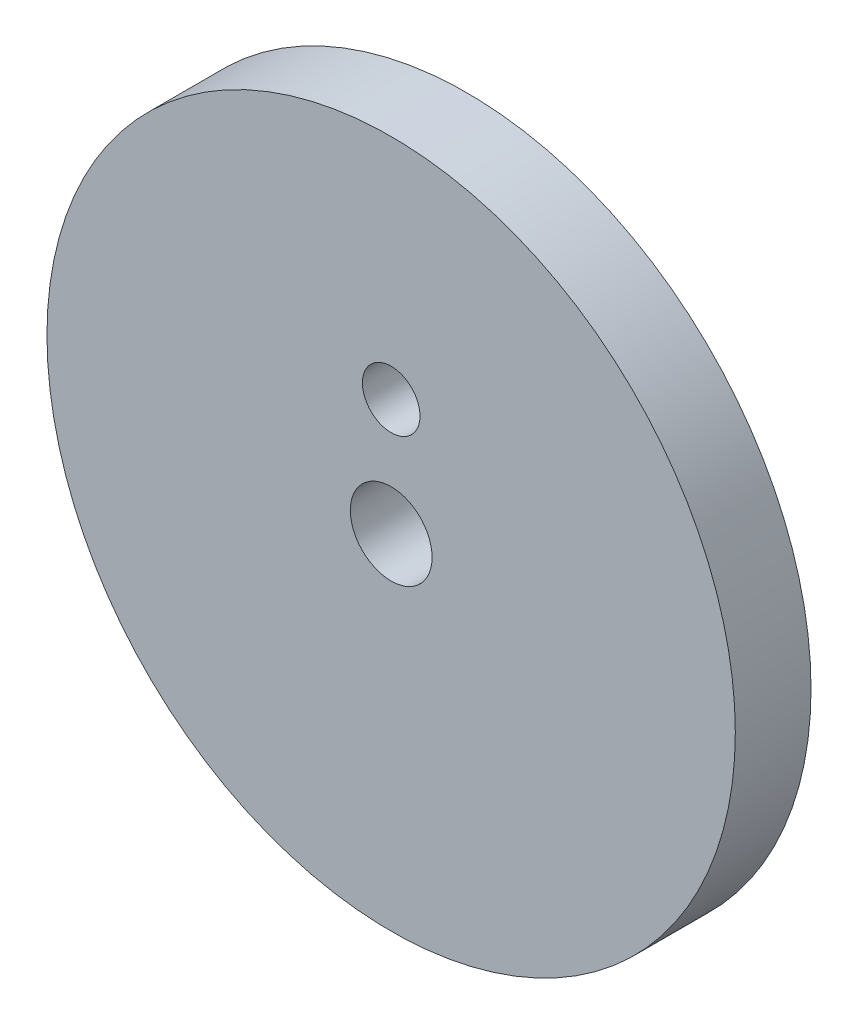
ISO-10303-21;
HEADER;
FILE_DESCRIPTION(('STEP AP214'),'2;1');
FILE_NAME('part.step','',(''),(''),'','','');
FILE_SCHEMA(('AUTOMOTIVE_DESIGN { 1 0 10303 214 1 1 1 1 }'));
ENDSEC;
DATA;
#1=APPLICATION_CONTEXT('core data for automotive mechanical design processes');
#2=APPLICATION_PROTOCOL_DEFINITION('international standard','automotive_design',2000,#1);
#3=PRODUCT_CONTEXT('',#1,'mechanical');
#4=PRODUCT('Part','Part','',(#3));
#5=PRODUCT_RELATED_PRODUCT_CATEGORY('part','',(#4));
#6=PRODUCT_DEFINITION_FORMATION('','',#4);
#7=PRODUCT_DEFINITION_CONTEXT('part definition',#1,'design');
#8=PRODUCT_DEFINITION('design','',#6,#7);
#9=PRODUCT_DEFINITION_SHAPE('','',#8);
#10=(LENGTH_UNIT() NAMED_UNIT(*) SI_UNIT(.MILLI.,.METRE.));
#11=(NAMED_UNIT(*) PLANE_ANGLE_UNIT() SI_UNIT($,.RADIAN.));
#12=(NAMED_UNIT(*) SI_UNIT($,.STERADIAN.) SOLID_ANGLE_UNIT());
#13=UNCERTAINTY_MEASURE_WITH_UNIT(LENGTH_MEASURE(1.E-05),#10,'distance_accuracy_value','');
#14=(GEOMETRIC_REPRESENTATION_CONTEXT(3) GLOBAL_UNCERTAINTY_ASSIGNED_CONTEXT((#13)) GLOBAL_UNIT_ASSIGNED_CONTEXT((#10,
#11,#12)) REPRESENTATION_CONTEXT('',''));
#15=CARTESIAN_POINT('',(0.,0.,0.));
#16=DIRECTION('',(0.,0.,1.));
#17=DIRECTION('',(1.,0.,0.));
#18=AXIS2_PLACEMENT_3D('',#15,#16,#17);
#19=CARTESIAN_POINT('',(0.,0.,8.8));
#20=DIRECTION('',(0.,0.,-1.));
#21=DIRECTION('',(-1.,0.,0.));
#22=AXIS2_PLACEMENT_3D('',#19,#20,#21);
#23=CYLINDRICAL_SURFACE('',#22,40.);
#24=CARTESIAN_POINT('',(0.,0.,8.8));
#25=DIRECTION('',(0.,0.,1.));
#26=DIRECTION('',(1.,0.,0.));
#27=AXIS2_PLACEMENT_3D('',#24,#25,#26);
#28=CIRCLE('',#27,40.);
#29=CARTESIAN_POINT('',(40.,0.,8.8));
#30=VERTEX_POINT('',#29);
#31=EDGE_CURVE('E10',#30,#30,#28,.T.);
#32=ORIENTED_EDGE('',*,*,#31,.F.);
#33=EDGE_LOOP('',(#32));
#34=FACE_BOUND('',#33,.T.);
#35=CARTESIAN_POINT('',(0.,0.,0.));
#36=DIRECTION('',(0.,0.,1.));
#37=DIRECTION('',(1.,0.,0.));
#38=AXIS2_PLACEMENT_3D('',#35,#36,#37);
#39=CIRCLE('',#38,40.);
#40=CARTESIAN_POINT('',(40.,0.,0.));
#41=VERTEX_POINT('',#40);
#42=EDGE_CURVE('E39',#41,#41,#39,.T.);
#43=ORIENTED_EDGE('',*,*,#42,.T.);
#44=EDGE_LOOP('',(#43));
#45=FACE_BOUND('',#44,.T.);
#46=ADVANCED_FACE('F36',(#34,#45),#23,.T.);
#47=CARTESIAN_POINT('',(0.,0.,8.8));
#48=DIRECTION('',(0.,0.,1.));
#49=DIRECTION('',(1.,0.,0.));
#50=AXIS2_PLACEMENT_3D('',#47,#48,#49);
#51=PLANE('',#50);
#52=CARTESIAN_POINT('',(0.00521979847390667,0.001535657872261,8.8));
#53=DIRECTION('',(0.,0.,1.));
#54=DIRECTION('',(1.,0.,0.));
#55=AXIS2_PLACEMENT_3D('',#52,#53,#54);
#56=CIRCLE('',#55,4.75);
#57=CARTESIAN_POINT('',(4.75521979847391,0.001535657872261,8.8));
#58=VERTEX_POINT('',#57);
#59=EDGE_CURVE('E59',#58,#58,#56,.T.);
#60=ORIENTED_EDGE('',*,*,#59,.F.);
#61=EDGE_LOOP('',(#60));
#62=FACE_BOUND('',#61,.T.);
#63=CARTESIAN_POINT('',(0.00521979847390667,13.5298712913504,8.8));
#64=DIRECTION('',(0.,0.,1.));
#65=DIRECTION('',(1.,0.,0.));
#66=AXIS2_PLACEMENT_3D('',#63,#64,#65);
#67=CIRCLE('',#66,3.34536233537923);
#68=CARTESIAN_POINT('',(3.35058213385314,13.5298712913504,8.8));
#69=VERTEX_POINT('',#68);
#70=EDGE_CURVE('E50',#69,#69,#67,.T.);
#71=ORIENTED_EDGE('',*,*,#70,.F.);
#72=EDGE_LOOP('',(#71));
#73=FACE_BOUND('',#72,.T.);
#74=ORIENTED_EDGE('',*,*,#31,.T.);
#75=EDGE_LOOP('',(#74));
#76=FACE_BOUND('',#75,.T.);
#77=ADVANCED_FACE('F103',(#62,#73,#76),#51,.T.);
#78=CARTESIAN_POINT('',(0.,0.,0.));
#79=DIRECTION('',(0.,0.,1.));
#80=DIRECTION('',(1.,0.,0.));
#81=AXIS2_PLACEMENT_3D('',#78,#79,#80);
#82=PLANE('',#81);
#83=CARTESIAN_POINT('',(-28.3603168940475,-16.3738365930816,0.));
#84=DIRECTION('',(0.,0.,-1.));
#85=DIRECTION('',(-1.,0.,0.));
#86=AXIS2_PLACEMENT_3D('',#83,#84,#85);
#87=CIRCLE('',#86,3.1);
#88=CARTESIAN_POINT('',(-31.4603168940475,-16.3738365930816,0.));
#89=VERTEX_POINT('',#88);
#90=EDGE_CURVE('E82',#89,#89,#87,.T.);
#91=ORIENTED_EDGE('',*,*,#90,.F.);
#92=EDGE_LOOP('',(#91));
#93=FACE_BOUND('',#92,.T.);
#94=CARTESIAN_POINT('',(-2.26949475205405E-12,32.7476731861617,0.));
#95=DIRECTION('',(0.,0.,-1.));
#96=DIRECTION('',(-1.,0.,0.));
#97=AXIS2_PLACEMENT_3D('',#94,#95,#96);
#98=CIRCLE('',#97,3.09999999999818);
#99=CARTESIAN_POINT('',(-3.10000000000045,32.7476731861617,0.));
#100=VERTEX_POINT('',#99);
#101=EDGE_CURVE('E74',#100,#100,#98,.T.);
#102=ORIENTED_EDGE('',*,*,#101,.F.);
#103=EDGE_LOOP('',(#102));
#104=FACE_BOUND('',#103,.T.);
#105=CARTESIAN_POINT('',(28.3603168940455,-16.3738365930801,0.));
#106=DIRECTION('',(0.,0.,-1.));
#107=DIRECTION('',(-1.,0.,0.));
#108=AXIS2_PLACEMENT_3D('',#105,#106,#107);
#109=CIRCLE('',#108,3.10000000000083);
#110=CARTESIAN_POINT('',(25.2603168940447,-16.3738365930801,0.));
#111=VERTEX_POINT('',#110);
#112=EDGE_CURVE('E66',#111,#111,#109,.T.);
#113=ORIENTED_EDGE('',*,*,#112,.F.);
#114=EDGE_LOOP('',(#113));
#115=FACE_BOUND('',#114,.T.);
#116=ORIENTED_EDGE('',*,*,#42,.F.);
#117=EDGE_LOOP('',(#116));
#118=FACE_BOUND('',#117,.T.);
#119=ADVANCED_FACE('F99',(#93,#104,#115,#118),#82,.F.);
#120=CARTESIAN_POINT('',(0.00521979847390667,13.5298712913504,0.8));
#121=DIRECTION('',(0.,0.,1.));
#122=DIRECTION('',(1.,0.,0.));
#123=AXIS2_PLACEMENT_3D('',#120,#121,#122);
#124=CYLINDRICAL_SURFACE('',#123,3.34536233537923);
#125=CARTESIAN_POINT('',(0.00521979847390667,13.5298712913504,0.8));
#126=DIRECTION('',(0.,0.,1.));
#127=DIRECTION('',(1.,0.,0.));
#128=AXIS2_PLACEMENT_3D('',#125,#126,#127);
#129=CIRCLE('',#128,3.34536233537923);
#130=CARTESIAN_POINT('',(3.35058213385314,13.5298712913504,0.8));
#131=VERTEX_POINT('',#130);
#132=EDGE_CURVE('E54',#131,#131,#129,.T.);
#133=ORIENTED_EDGE('',*,*,#132,.F.);
#134=EDGE_LOOP('',(#133));
#135=FACE_BOUND('',#134,.T.);
#136=ORIENTED_EDGE('',*,*,#70,.T.);
#137=EDGE_LOOP('',(#136));
#138=FACE_BOUND('',#137,.T.);
#139=ADVANCED_FACE('F102',(#135,#138),#124,.F.);
#140=CARTESIAN_POINT('',(0.00521979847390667,13.5298712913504,0.8));
#141=DIRECTION('',(0.,0.,1.));
#142=DIRECTION('',(1.,0.,0.));
#143=AXIS2_PLACEMENT_3D('',#140,#141,#142);
#144=PLANE('',#143);
#145=ORIENTED_EDGE('',*,*,#132,.T.);
#146=EDGE_LOOP('',(#145));
#147=FACE_BOUND('',#146,.T.);
#148=ADVANCED_FACE('F125',(#147),#144,.T.);
#149=CARTESIAN_POINT('',(0.00521979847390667,0.001535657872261,0.8));
#150=DIRECTION('',(0.,0.,1.));
#151=DIRECTION('',(1.,0.,0.));
#152=AXIS2_PLACEMENT_3D('',#149,#150,#151);
#153=CYLINDRICAL_SURFACE('',#152,4.75);
#154=CARTESIAN_POINT('',(0.00521979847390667,0.001535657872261,0.8));
#155=DIRECTION('',(0.,0.,1.));
#156=DIRECTION('',(1.,0.,0.));
#157=AXIS2_PLACEMENT_3D('',#154,#155,#156);
#158=CIRCLE('',#157,4.75);
#159=CARTESIAN_POINT('',(4.75521979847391,0.001535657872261,0.8));
#160=VERTEX_POINT('',#159);
#161=EDGE_CURVE('E48',#160,#160,#158,.T.);
#162=ORIENTED_EDGE('',*,*,#161,.F.);
#163=EDGE_LOOP('',(#162));
#164=FACE_BOUND('',#163,.T.);
#165=ORIENTED_EDGE('',*,*,#59,.T.);
#166=EDGE_LOOP('',(#165));
#167=FACE_BOUND('',#166,.T.);
#168=ADVANCED_FACE('F129',(#164,#167),#153,.F.);
#169=CARTESIAN_POINT('',(0.00521979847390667,0.001535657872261,0.8));
#170=DIRECTION('',(0.,0.,1.));
#171=DIRECTION('',(1.,0.,0.));
#172=AXIS2_PLACEMENT_3D('',#169,#170,#171);
#173=PLANE('',#172);
#174=ORIENTED_EDGE('',*,*,#161,.T.);
#175=EDGE_LOOP('',(#174));
#176=FACE_BOUND('',#175,.T.);
#177=ADVANCED_FACE('F133',(#176),#173,.T.);
#178=CARTESIAN_POINT('',(28.3603168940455,-16.3738365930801,8.));
#179=DIRECTION('',(0.,0.,-1.));
#180=DIRECTION('',(-1.,0.,0.));
#181=AXIS2_PLACEMENT_3D('',#178,#179,#180);
#182=CYLINDRICAL_SURFACE('',#181,3.10000000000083);
#183=CARTESIAN_POINT('',(28.3603168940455,-16.3738365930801,8.));
#184=DIRECTION('',(0.,0.,-1.));
#185=DIRECTION('',(-1.,0.,0.));
#186=AXIS2_PLACEMENT_3D('',#183,#184,#185);
#187=CIRCLE('',#186,3.10000000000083);
#188=CARTESIAN_POINT('',(25.2603168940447,-16.3738365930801,8.));
#189=VERTEX_POINT('',#188);
#190=EDGE_CURVE('E70',#189,#189,#187,.T.);
#191=ORIENTED_EDGE('',*,*,#190,.F.);
#192=EDGE_LOOP('',(#191));
#193=FACE_BOUND('',#192,.T.);
#194=ORIENTED_EDGE('',*,*,#112,.T.);
#195=EDGE_LOOP('',(#194));
#196=FACE_BOUND('',#195,.T.);
#197=ADVANCED_FACE('F137',(#193,#196),#182,.F.);
#198=CARTESIAN_POINT('',(28.3603168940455,-16.3738365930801,8.));
#199=DIRECTION('',(0.,0.,-1.));
#200=DIRECTION('',(-1.,0.,0.));
#201=AXIS2_PLACEMENT_3D('',#198,#199,#200);
#202=PLANE('',#201);
#203=ORIENTED_EDGE('',*,*,#190,.T.);
#204=EDGE_LOOP('',(#203));
#205=FACE_BOUND('',#204,.T.);
#206=ADVANCED_FACE('F141',(#205),#202,.T.);
#207=CARTESIAN_POINT('',(-2.26949475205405E-12,32.7476731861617,8.));
#208=DIRECTION('',(0.,0.,-1.));
#209=DIRECTION('',(-1.,0.,0.));
#210=AXIS2_PLACEMENT_3D('',#207,#208,#209);
#211=CYLINDRICAL_SURFACE('',#210,3.09999999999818);
#212=CARTESIAN_POINT('',(-2.26949475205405E-12,32.7476731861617,8.));
#213=DIRECTION('',(0.,0.,-1.));
#214=DIRECTION('',(-1.,0.,0.));
#215=AXIS2_PLACEMENT_3D('',#212,#213,#214);
#216=CIRCLE('',#215,3.09999999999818);
#217=CARTESIAN_POINT('',(-3.10000000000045,32.7476731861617,8.));
#218=VERTEX_POINT('',#217);
#219=EDGE_CURVE('E78',#218,#218,#216,.T.);
#220=ORIENTED_EDGE('',*,*,#219,.F.);
#221=EDGE_LOOP('',(#220));
#222=FACE_BOUND('',#221,.T.);
#223=ORIENTED_EDGE('',*,*,#101,.T.);
#224=EDGE_LOOP('',(#223));
#225=FACE_BOUND('',#224,.T.);
#226=ADVANCED_FACE('F145',(#222,#225),#211,.F.);
#227=CARTESIAN_POINT('',(-2.26949475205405E-12,32.7476731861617,8.));
#228=DIRECTION('',(0.,0.,-1.));
#229=DIRECTION('',(-1.,0.,0.));
#230=AXIS2_PLACEMENT_3D('',#227,#228,#229);
#231=PLANE('',#230);
#232=ORIENTED_EDGE('',*,*,#219,.T.);
#233=EDGE_LOOP('',(#232));
#234=FACE_BOUND('',#233,.T.);
#235=ADVANCED_FACE('F95',(#234),#231,.T.);
#236=CARTESIAN_POINT('',(-28.3603168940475,-16.3738365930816,8.));
#237=DIRECTION('',(0.,0.,-1.));
#238=DIRECTION('',(-1.,0.,0.));
#239=AXIS2_PLACEMENT_3D('',#236,#237,#238);
#240=CYLINDRICAL_SURFACE('',#239,3.1);
#241=CARTESIAN_POINT('',(-28.3603168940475,-16.3738365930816,8.));
#242=DIRECTION('',(0.,0.,-1.));
#243=DIRECTION('',(-1.,0.,0.));
#244=AXIS2_PLACEMENT_3D('',#241,#242,#243);
#245=CIRCLE('',#244,3.1);
#246=CARTESIAN_POINT('',(-31.4603168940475,-16.3738365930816,8.));
#247=VERTEX_POINT('',#246);
#248=EDGE_CURVE('E55',#247,#247,#245,.T.);
#249=ORIENTED_EDGE('',*,*,#248,.F.);
#250=EDGE_LOOP('',(#249));
#251=FACE_BOUND('',#250,.T.);
#252=ORIENTED_EDGE('',*,*,#90,.T.);
#253=EDGE_LOOP('',(#252));
#254=FACE_BOUND('',#253,.T.);
#255=ADVANCED_FACE('F92',(#251,#254),#240,.F.);
#256=CARTESIAN_POINT('',(-28.3603168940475,-16.3738365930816,8.));
#257=DIRECTION('',(0.,0.,-1.));
#258=DIRECTION('',(-1.,0.,0.));
#259=AXIS2_PLACEMENT_3D('',#256,#257,#258);
#260=PLANE('',#259);
#261=ORIENTED_EDGE('',*,*,#248,.T.);
#262=EDGE_LOOP('',(#261));
#263=FACE_BOUND('',#262,.T.);
#264=ADVANCED_FACE('F90',(#263),#260,.T.);
#265=CLOSED_SHELL('',(#46,#77,#119,#139,#148,#168,#177,#197,#206,#226,#235,#255,#264));
#266=MANIFOLD_SOLID_BREP('B2',#265);
#267=ADVANCED_BREP_SHAPE_REPRESENTATION('',(#18,#266),#14);
#268=SHAPE_DEFINITION_REPRESENTATION(#9,#267);
ENDSEC;
END-ISO-10303-21;
